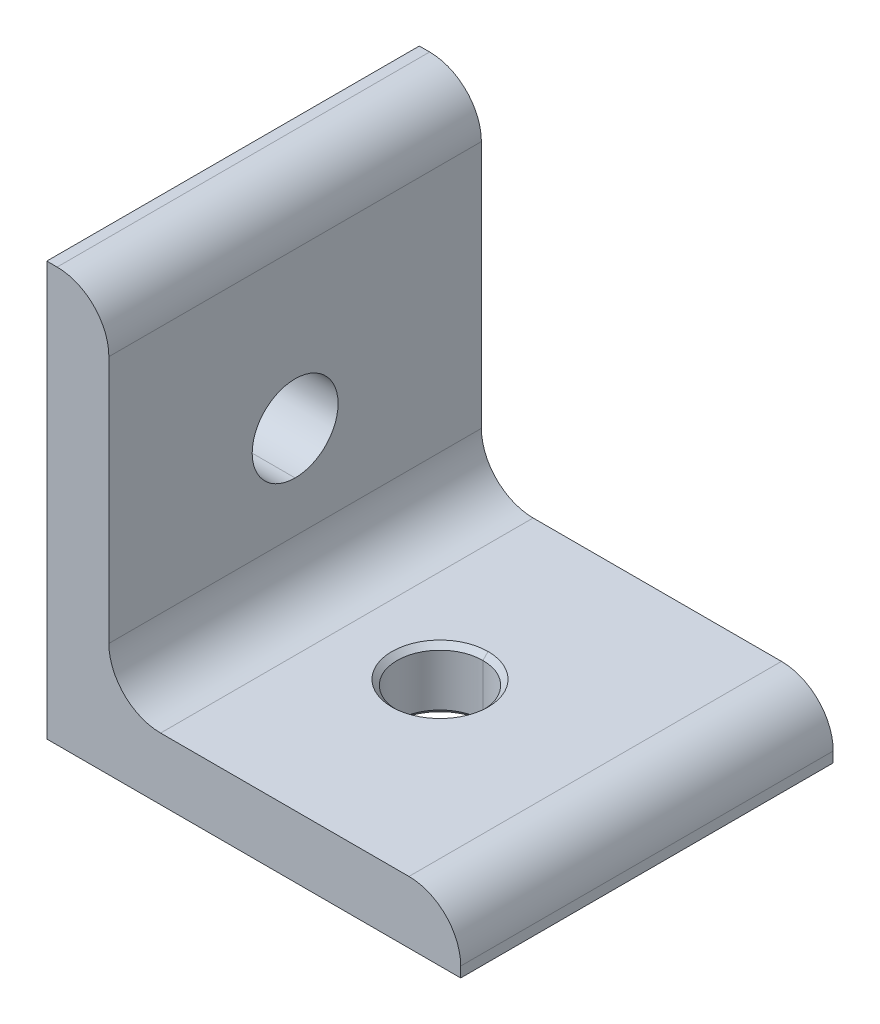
ISO-10303-21;
HEADER;
FILE_DESCRIPTION(('STEP AP214'),'2;1');
FILE_NAME('part.step','',(''),(''),'','','');
FILE_SCHEMA(('AUTOMOTIVE_DESIGN { 1 0 10303 214 1 1 1 1 }'));
ENDSEC;
DATA;
#1=APPLICATION_CONTEXT('core data for automotive mechanical design processes');
#2=APPLICATION_PROTOCOL_DEFINITION('international standard','automotive_design',2000,#1);
#3=PRODUCT_CONTEXT('',#1,'mechanical');
#4=PRODUCT('Part','Part','',(#3));
#5=PRODUCT_RELATED_PRODUCT_CATEGORY('part','',(#4));
#6=PRODUCT_DEFINITION_FORMATION('','',#4);
#7=PRODUCT_DEFINITION_CONTEXT('part definition',#1,'design');
#8=PRODUCT_DEFINITION('design','',#6,#7);
#9=PRODUCT_DEFINITION_SHAPE('','',#8);
#10=(LENGTH_UNIT() NAMED_UNIT(*) SI_UNIT(.MILLI.,.METRE.));
#11=(NAMED_UNIT(*) PLANE_ANGLE_UNIT() SI_UNIT($,.RADIAN.));
#12=(NAMED_UNIT(*) SI_UNIT($,.STERADIAN.) SOLID_ANGLE_UNIT());
#13=UNCERTAINTY_MEASURE_WITH_UNIT(LENGTH_MEASURE(1.E-05),#10,'distance_accuracy_value','');
#14=(GEOMETRIC_REPRESENTATION_CONTEXT(3) GLOBAL_UNCERTAINTY_ASSIGNED_CONTEXT((#13)) GLOBAL_UNIT_ASSIGNED_CONTEXT((#10,
#11,#12)) REPRESENTATION_CONTEXT('',''));
#15=CARTESIAN_POINT('',(0.,0.,0.));
#16=DIRECTION('',(0.,0.,1.));
#17=DIRECTION('',(1.,0.,0.));
#18=AXIS2_PLACEMENT_3D('',#15,#16,#17);
#19=CARTESIAN_POINT('',(310.435821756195,291.02165795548,0.));
#20=DIRECTION('',(0.,1.,0.));
#21=DIRECTION('',(0.,0.,-1.));
#22=AXIS2_PLACEMENT_3D('',#19,#20,#21);
#23=CYLINDRICAL_SURFACE('',#22,4.15);
#24=DIRECTION('',(0.,-1.,0.));
#25=VECTOR('',#24,1.);
#26=CARTESIAN_POINT('',(310.435821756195,296.12165795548,-4.15000000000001));
#27=LINE('',#26,#25);
#28=CARTESIAN_POINT('',(310.435821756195,296.12165795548,-4.15000000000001));
#29=VERTEX_POINT('',#28);
#30=CARTESIAN_POINT('',(310.435821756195,291.12165795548,-4.15000000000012));
#31=VERTEX_POINT('',#30);
#32=EDGE_CURVE('E51',#29,#31,#27,.T.);
#33=ORIENTED_EDGE('',*,*,#32,.T.);
#34=CARTESIAN_POINT('',(310.435821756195,291.12165795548,0.));
#35=DIRECTION('',(0.,1.,0.));
#36=DIRECTION('',(-1.5204820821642E-09,0.,1.));
#37=AXIS2_PLACEMENT_3D('',#34,#35,#36);
#38=CIRCLE('',#37,4.1500000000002);
#39=CARTESIAN_POINT('',(310.435821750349,291.12165795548,4.15000000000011));
#40=VERTEX_POINT('',#39);
#41=EDGE_CURVE('E321',#40,#31,#38,.T.);
#42=ORIENTED_EDGE('',*,*,#41,.F.);
#43=DIRECTION('',(0.,1.,0.));
#44=VECTOR('',#43,1.);
#45=CARTESIAN_POINT('',(310.435821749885,291.12165795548,4.14999999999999));
#46=LINE('',#45,#44);
#47=CARTESIAN_POINT('',(310.435821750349,296.12165795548,4.14999999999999));
#48=VERTEX_POINT('',#47);
#49=EDGE_CURVE('E68',#40,#48,#46,.T.);
#50=ORIENTED_EDGE('',*,*,#49,.T.);
#51=CARTESIAN_POINT('',(310.435821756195,296.12165795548,0.));
#52=DIRECTION('',(0.,-1.,0.));
#53=DIRECTION('',(0.,0.,-1.));
#54=AXIS2_PLACEMENT_3D('',#51,#52,#53);
#55=CIRCLE('',#54,4.15);
#56=EDGE_CURVE('E12',#29,#48,#55,.T.);
#57=ORIENTED_EDGE('',*,*,#56,.F.);
#58=EDGE_LOOP('',(#33,#42,#50,#57));
#59=FACE_BOUND('',#58,.T.);
#60=ADVANCED_FACE('F48',(#59),#23,.F.);
#61=CARTESIAN_POINT('',(310.435821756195,296.064762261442,0.));
#62=DIRECTION('',(0.,1.,0.));
#63=DIRECTION('',(0.,0.,-1.));
#64=AXIS2_PLACEMENT_3D('',#61,#62,#63);
#65=CONICAL_SURFACE('',#64,4.09310430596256,0.785398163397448);
#66=DIRECTION('',(0.,-0.707106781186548,0.707106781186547));
#67=VECTOR('',#66,1.);
#68=CARTESIAN_POINT('',(310.435821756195,296.62165795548,-4.65000000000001));
#69=LINE('',#68,#67);
#70=CARTESIAN_POINT('',(310.435821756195,296.62165795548,-4.65000000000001));
#71=VERTEX_POINT('',#70);
#72=EDGE_CURVE('E340',#71,#29,#69,.T.);
#73=ORIENTED_EDGE('',*,*,#72,.T.);
#74=ORIENTED_EDGE('',*,*,#56,.T.);
#75=DIRECTION('',(-9.16977266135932E-10,0.707106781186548,0.707106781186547));
#76=VECTOR('',#75,1.);
#77=CARTESIAN_POINT('',(310.435821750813,296.12165795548,4.14999999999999));
#78=LINE('',#77,#76);
#79=CARTESIAN_POINT('',(310.435821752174,296.62165795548,4.64999999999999));
#80=VERTEX_POINT('',#79);
#81=EDGE_CURVE('E57',#48,#80,#78,.T.);
#82=ORIENTED_EDGE('',*,*,#81,.T.);
#83=CARTESIAN_POINT('',(310.435821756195,296.62165795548,0.));
#84=DIRECTION('',(0.,-1.,0.));
#85=DIRECTION('',(0.,0.,-1.));
#86=AXIS2_PLACEMENT_3D('',#83,#84,#85);
#87=CIRCLE('',#86,4.65);
#88=EDGE_CURVE('E215',#71,#80,#87,.T.);
#89=ORIENTED_EDGE('',*,*,#88,.F.);
#90=EDGE_LOOP('',(#73,#74,#82,#89));
#91=FACE_BOUND('',#90,.T.);
#92=ADVANCED_FACE('F416',(#91),#65,.F.);
#93=CARTESIAN_POINT('',(310.435821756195,296.064762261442,0.));
#94=DIRECTION('',(0.,1.,0.));
#95=DIRECTION('',(0.,0.,-1.));
#96=AXIS2_PLACEMENT_3D('',#93,#94,#95);
#97=CONICAL_SURFACE('',#96,4.09310430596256,0.785398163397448);
#98=ORIENTED_EDGE('',*,*,#81,.F.);
#99=CARTESIAN_POINT('',(310.435821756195,296.12165795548,0.));
#100=DIRECTION('',(0.,-1.,0.));
#101=DIRECTION('',(-1.52048208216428E-09,0.,1.));
#102=AXIS2_PLACEMENT_3D('',#99,#100,#101);
#103=CIRCLE('',#102,4.15);
#104=EDGE_CURVE('E332',#48,#29,#103,.T.);
#105=ORIENTED_EDGE('',*,*,#104,.T.);
#106=ORIENTED_EDGE('',*,*,#72,.F.);
#107=CARTESIAN_POINT('',(310.435821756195,296.62165795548,0.));
#108=DIRECTION('',(0.,-1.,0.));
#109=DIRECTION('',(0.,0.,1.));
#110=AXIS2_PLACEMENT_3D('',#107,#108,#109);
#111=CIRCLE('',#110,4.65);
#112=EDGE_CURVE('E254',#80,#71,#111,.T.);
#113=ORIENTED_EDGE('',*,*,#112,.F.);
#114=EDGE_LOOP('',(#98,#105,#106,#113));
#115=FACE_BOUND('',#114,.T.);
#116=ADVANCED_FACE('F420',(#115),#97,.F.);
#117=CARTESIAN_POINT('',(310.435821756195,291.02165795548,0.));
#118=DIRECTION('',(0.,1.,0.));
#119=DIRECTION('',(0.,0.,-1.));
#120=AXIS2_PLACEMENT_3D('',#117,#118,#119);
#121=CYLINDRICAL_SURFACE('',#120,4.15);
#122=ORIENTED_EDGE('',*,*,#49,.F.);
#123=CARTESIAN_POINT('',(310.435821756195,291.12165795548,0.));
#124=DIRECTION('',(0.,1.,0.));
#125=DIRECTION('',(0.,0.,-1.));
#126=AXIS2_PLACEMENT_3D('',#123,#124,#125);
#127=CIRCLE('',#126,4.1500000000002);
#128=EDGE_CURVE('E328',#31,#40,#127,.T.);
#129=ORIENTED_EDGE('',*,*,#128,.F.);
#130=ORIENTED_EDGE('',*,*,#32,.F.);
#131=ORIENTED_EDGE('',*,*,#104,.F.);
#132=EDGE_LOOP('',(#122,#129,#130,#131));
#133=FACE_BOUND('',#132,.T.);
#134=ADVANCED_FACE('F349',(#133),#121,.F.);
#135=CARTESIAN_POINT('',(310.435821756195,291.178553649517,0.));
#136=DIRECTION('',(0.,-1.,0.));
#137=DIRECTION('',(0.,0.,-1.));
#138=AXIS2_PLACEMENT_3D('',#135,#136,#137);
#139=CONICAL_SURFACE('',#138,4.09310430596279,0.785398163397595);
#140=DIRECTION('',(0.,0.707106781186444,0.707106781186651));
#141=VECTOR('',#140,1.);
#142=CARTESIAN_POINT('',(310.435821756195,290.62165795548,-4.65000000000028));
#143=LINE('',#142,#141);
#144=CARTESIAN_POINT('',(310.435821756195,290.62165795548,-4.6500000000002));
#145=VERTEX_POINT('',#144);
#146=EDGE_CURVE('E317',#145,#31,#143,.T.);
#147=ORIENTED_EDGE('',*,*,#146,.T.);
#148=ORIENTED_EDGE('',*,*,#128,.T.);
#149=DIRECTION('',(-9.16964903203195E-10,-0.707106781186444,0.707106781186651));
#150=VECTOR('',#149,1.);
#151=CARTESIAN_POINT('',(310.435821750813,291.12165795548,4.15000000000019));
#152=LINE('',#151,#150);
#153=CARTESIAN_POINT('',(310.435821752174,290.62165795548,4.65000000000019));
#154=VERTEX_POINT('',#153);
#155=EDGE_CURVE('E325',#40,#154,#152,.T.);
#156=ORIENTED_EDGE('',*,*,#155,.T.);
#157=CARTESIAN_POINT('',(310.435821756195,290.62165795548,0.));
#158=DIRECTION('',(0.,1.,0.));
#159=DIRECTION('',(0.,0.,-1.));
#160=AXIS2_PLACEMENT_3D('',#157,#158,#159);
#161=CIRCLE('',#160,4.65000000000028);
#162=EDGE_CURVE('E276',#145,#154,#161,.T.);
#163=ORIENTED_EDGE('',*,*,#162,.F.);
#164=EDGE_LOOP('',(#147,#148,#156,#163));
#165=FACE_BOUND('',#164,.T.);
#166=ADVANCED_FACE('F353',(#165),#139,.F.);
#167=CARTESIAN_POINT('',(310.435821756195,291.178553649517,0.));
#168=DIRECTION('',(0.,-1.,0.));
#169=DIRECTION('',(0.,0.,-1.));
#170=AXIS2_PLACEMENT_3D('',#167,#168,#169);
#171=CONICAL_SURFACE('',#170,4.09310430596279,0.785398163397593);
#172=ORIENTED_EDGE('',*,*,#155,.F.);
#173=ORIENTED_EDGE('',*,*,#41,.T.);
#174=ORIENTED_EDGE('',*,*,#146,.F.);
#175=CARTESIAN_POINT('',(310.435821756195,290.62165795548,0.));
#176=DIRECTION('',(0.,1.,0.));
#177=DIRECTION('',(0.,0.,1.));
#178=AXIS2_PLACEMENT_3D('',#175,#176,#177);
#179=CIRCLE('',#178,4.65000000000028);
#180=EDGE_CURVE('E272',#154,#145,#179,.T.);
#181=ORIENTED_EDGE('',*,*,#180,.F.);
#182=EDGE_LOOP('',(#172,#173,#174,#181));
#183=FACE_BOUND('',#182,.T.);
#184=ADVANCED_FACE('F356',(#183),#171,.F.);
#185=CARTESIAN_POINT('',(290.315821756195,310.62165795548,0.));
#186=DIRECTION('',(1.,0.,0.));
#187=DIRECTION('',(0.,1.,0.));
#188=AXIS2_PLACEMENT_3D('',#185,#186,#187);
#189=CYLINDRICAL_SURFACE('',#188,4.15);
#190=DIRECTION('',(-1.,0.,0.));
#191=VECTOR('',#190,1.);
#192=CARTESIAN_POINT('',(296.435821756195,314.77165795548,0.));
#193=LINE('',#192,#191);
#194=CARTESIAN_POINT('',(296.435821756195,314.77165795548,0.));
#195=VERTEX_POINT('',#194);
#196=CARTESIAN_POINT('',(290.435821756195,314.77165795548,0.));
#197=VERTEX_POINT('',#196);
#198=EDGE_CURVE('E305',#195,#197,#193,.T.);
#199=ORIENTED_EDGE('',*,*,#198,.T.);
#200=CARTESIAN_POINT('',(290.435821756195,310.62165795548,0.));
#201=DIRECTION('',(1.,0.,0.));
#202=DIRECTION('',(0.,-1.,0.));
#203=AXIS2_PLACEMENT_3D('',#200,#201,#202);
#204=CIRCLE('',#203,4.15);
#205=CARTESIAN_POINT('',(290.435821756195,306.47165795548,0.));
#206=VERTEX_POINT('',#205);
#207=EDGE_CURVE('E306',#206,#197,#204,.T.);
#208=ORIENTED_EDGE('',*,*,#207,.F.);
#209=DIRECTION('',(1.,0.,0.));
#210=VECTOR('',#209,1.);
#211=CARTESIAN_POINT('',(290.435821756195,306.47165795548,0.));
#212=LINE('',#211,#210);
#213=CARTESIAN_POINT('',(296.435821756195,306.47165795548,0.));
#214=VERTEX_POINT('',#213);
#215=EDGE_CURVE('E309',#206,#214,#212,.T.);
#216=ORIENTED_EDGE('',*,*,#215,.T.);
#217=CARTESIAN_POINT('',(296.435821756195,310.62165795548,0.));
#218=DIRECTION('',(-1.,0.,0.));
#219=DIRECTION('',(0.,1.,0.));
#220=AXIS2_PLACEMENT_3D('',#217,#218,#219);
#221=CIRCLE('',#220,4.15);
#222=EDGE_CURVE('E237',#195,#214,#221,.T.);
#223=ORIENTED_EDGE('',*,*,#222,.F.);
#224=EDGE_LOOP('',(#199,#208,#216,#223));
#225=FACE_BOUND('',#224,.T.);
#226=ADVANCED_FACE('F387',(#225),#189,.F.);
#227=CARTESIAN_POINT('',(290.315821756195,310.62165795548,0.));
#228=DIRECTION('',(1.,0.,0.));
#229=DIRECTION('',(0.,1.,0.));
#230=AXIS2_PLACEMENT_3D('',#227,#228,#229);
#231=CYLINDRICAL_SURFACE('',#230,4.15);
#232=ORIENTED_EDGE('',*,*,#215,.F.);
#233=CARTESIAN_POINT('',(290.435821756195,310.62165795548,0.));
#234=DIRECTION('',(1.,0.,0.));
#235=DIRECTION('',(0.,1.,0.));
#236=AXIS2_PLACEMENT_3D('',#233,#234,#235);
#237=CIRCLE('',#236,4.15);
#238=EDGE_CURVE('E287',#197,#206,#237,.T.);
#239=ORIENTED_EDGE('',*,*,#238,.F.);
#240=ORIENTED_EDGE('',*,*,#198,.F.);
#241=CARTESIAN_POINT('',(296.435821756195,310.62165795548,0.));
#242=DIRECTION('',(-1.,0.,0.));
#243=DIRECTION('',(0.,-1.,0.));
#244=AXIS2_PLACEMENT_3D('',#241,#242,#243);
#245=CIRCLE('',#244,4.15);
#246=EDGE_CURVE('E242',#214,#195,#245,.T.);
#247=ORIENTED_EDGE('',*,*,#246,.F.);
#248=EDGE_LOOP('',(#232,#239,#240,#247));
#249=FACE_BOUND('',#248,.T.);
#250=ADVANCED_FACE('F383',(#249),#231,.F.);
#251=CARTESIAN_POINT('',(310.435821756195,310.62165795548,18.));
#252=DIRECTION('',(0.,0.,1.));
#253=DIRECTION('',(1.,0.,0.));
#254=AXIS2_PLACEMENT_3D('',#251,#252,#253);
#255=PLANE('',#254);
#256=DIRECTION('',(-1.,0.,0.));
#257=VECTOR('',#256,1.);
#258=CARTESIAN_POINT('',(291.435821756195,330.62165795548,18.));
#259=LINE('',#258,#257);
#260=CARTESIAN_POINT('',(291.435821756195,330.62165795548,18.));
#261=VERTEX_POINT('',#260);
#262=CARTESIAN_POINT('',(290.435821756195,330.62165795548,18.));
#263=VERTEX_POINT('',#262);
#264=EDGE_CURVE('E298',#261,#263,#259,.T.);
#265=ORIENTED_EDGE('',*,*,#264,.T.);
#266=DIRECTION('',(0.,-1.,0.));
#267=VECTOR('',#266,1.);
#268=CARTESIAN_POINT('',(290.435821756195,330.62165795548,18.));
#269=LINE('',#268,#267);
#270=CARTESIAN_POINT('',(290.435821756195,290.62165795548,18.));
#271=VERTEX_POINT('',#270);
#272=EDGE_CURVE('E314',#263,#271,#269,.T.);
#273=ORIENTED_EDGE('',*,*,#272,.T.);
#274=DIRECTION('',(1.,0.,0.));
#275=VECTOR('',#274,1.);
#276=CARTESIAN_POINT('',(290.435821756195,290.62165795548,18.));
#277=LINE('',#276,#275);
#278=CARTESIAN_POINT('',(330.435821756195,290.62165795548,18.));
#279=VERTEX_POINT('',#278);
#280=EDGE_CURVE('E226',#271,#279,#277,.T.);
#281=ORIENTED_EDGE('',*,*,#280,.T.);
#282=DIRECTION('',(0.,1.,0.));
#283=VECTOR('',#282,1.);
#284=CARTESIAN_POINT('',(330.435821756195,290.62165795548,18.));
#285=LINE('',#284,#283);
#286=CARTESIAN_POINT('',(330.435821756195,291.62165795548,18.));
#287=VERTEX_POINT('',#286);
#288=EDGE_CURVE('E221',#279,#287,#285,.T.);
#289=ORIENTED_EDGE('',*,*,#288,.T.);
#290=CARTESIAN_POINT('',(325.435821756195,291.62165795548,18.));
#291=DIRECTION('',(0.,0.,1.));
#292=DIRECTION('',(1.,0.,0.));
#293=AXIS2_PLACEMENT_3D('',#290,#291,#292);
#294=CIRCLE('',#293,5.);
#295=CARTESIAN_POINT('',(325.435821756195,296.62165795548,18.));
#296=VERTEX_POINT('',#295);
#297=EDGE_CURVE('E216',#287,#296,#294,.T.);
#298=ORIENTED_EDGE('',*,*,#297,.T.);
#299=DIRECTION('',(-1.,0.,0.));
#300=VECTOR('',#299,1.);
#301=CARTESIAN_POINT('',(325.435821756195,296.62165795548,18.));
#302=LINE('',#301,#300);
#303=CARTESIAN_POINT('',(301.435821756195,296.62165795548,18.));
#304=VERTEX_POINT('',#303);
#305=EDGE_CURVE('E212',#296,#304,#302,.T.);
#306=ORIENTED_EDGE('',*,*,#305,.T.);
#307=CARTESIAN_POINT('',(301.435821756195,301.62165795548,18.));
#308=DIRECTION('',(0.,0.,-1.));
#309=DIRECTION('',(0.,-1.,0.));
#310=AXIS2_PLACEMENT_3D('',#307,#308,#309);
#311=CIRCLE('',#310,5.);
#312=CARTESIAN_POINT('',(296.435821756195,301.62165795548,18.));
#313=VERTEX_POINT('',#312);
#314=EDGE_CURVE('E202',#304,#313,#311,.T.);
#315=ORIENTED_EDGE('',*,*,#314,.T.);
#316=DIRECTION('',(0.,1.,0.));
#317=VECTOR('',#316,1.);
#318=CARTESIAN_POINT('',(296.435821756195,301.62165795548,18.));
#319=LINE('',#318,#317);
#320=CARTESIAN_POINT('',(296.435821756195,325.62165795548,18.));
#321=VERTEX_POINT('',#320);
#322=EDGE_CURVE('E209',#313,#321,#319,.T.);
#323=ORIENTED_EDGE('',*,*,#322,.T.);
#324=CARTESIAN_POINT('',(291.435821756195,325.62165795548,18.));
#325=DIRECTION('',(0.,0.,1.));
#326=DIRECTION('',(1.,0.,0.));
#327=AXIS2_PLACEMENT_3D('',#324,#325,#326);
#328=CIRCLE('',#327,5.);
#329=EDGE_CURVE('E174',#321,#261,#328,.T.);
#330=ORIENTED_EDGE('',*,*,#329,.T.);
#331=EDGE_LOOP('',(#265,#273,#281,#289,#298,#306,#315,#323,#330));
#332=FACE_BOUND('',#331,.T.);
#333=ADVANCED_FACE('F297',(#332),#255,.T.);
#334=CARTESIAN_POINT('',(290.935821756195,330.62165795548,0.));
#335=DIRECTION('',(0.,1.,0.));
#336=DIRECTION('',(-1.,0.,0.));
#337=AXIS2_PLACEMENT_3D('',#334,#335,#336);
#338=PLANE('',#337);
#339=DIRECTION('',(-1.,0.,0.));
#340=VECTOR('',#339,1.);
#341=CARTESIAN_POINT('',(291.435821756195,330.62165795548,-18.));
#342=LINE('',#341,#340);
#343=CARTESIAN_POINT('',(291.435821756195,330.62165795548,-18.));
#344=VERTEX_POINT('',#343);
#345=CARTESIAN_POINT('',(290.435821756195,330.62165795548,-18.));
#346=VERTEX_POINT('',#345);
#347=EDGE_CURVE('E179',#344,#346,#342,.T.);
#348=ORIENTED_EDGE('',*,*,#347,.T.);
#349=DIRECTION('',(0.,0.,1.));
#350=VECTOR('',#349,1.);
#351=CARTESIAN_POINT('',(290.435821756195,330.62165795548,-18.));
#352=LINE('',#351,#350);
#353=EDGE_CURVE('E280',#346,#263,#352,.T.);
#354=ORIENTED_EDGE('',*,*,#353,.T.);
#355=ORIENTED_EDGE('',*,*,#264,.F.);
#356=DIRECTION('',(0.,0.,-1.));
#357=VECTOR('',#356,1.);
#358=CARTESIAN_POINT('',(291.435821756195,330.62165795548,18.));
#359=LINE('',#358,#357);
#360=EDGE_CURVE('E193',#261,#344,#359,.T.);
#361=ORIENTED_EDGE('',*,*,#360,.T.);
#362=EDGE_LOOP('',(#348,#354,#355,#361));
#363=FACE_BOUND('',#362,.T.);
#364=ADVANCED_FACE('F301',(#363),#338,.T.);
#365=CARTESIAN_POINT('',(290.435821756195,310.62165795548,0.));
#366=DIRECTION('',(1.,0.,0.));
#367=DIRECTION('',(0.,-1.,0.));
#368=AXIS2_PLACEMENT_3D('',#365,#366,#367);
#369=PLANE('',#368);
#370=ORIENTED_EDGE('',*,*,#207,.T.);
#371=ORIENTED_EDGE('',*,*,#238,.T.);
#372=EDGE_LOOP('',(#370,#371));
#373=FACE_BOUND('',#372,.T.);
#374=DIRECTION('',(0.,0.,1.));
#375=VECTOR('',#374,1.);
#376=CARTESIAN_POINT('',(290.435821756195,290.62165795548,-18.));
#377=LINE('',#376,#375);
#378=CARTESIAN_POINT('',(290.435821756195,290.62165795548,-18.));
#379=VERTEX_POINT('',#378);
#380=EDGE_CURVE('E225',#379,#271,#377,.T.);
#381=ORIENTED_EDGE('',*,*,#380,.T.);
#382=ORIENTED_EDGE('',*,*,#272,.F.);
#383=ORIENTED_EDGE('',*,*,#353,.F.);
#384=DIRECTION('',(0.,-1.,0.));
#385=VECTOR('',#384,1.);
#386=CARTESIAN_POINT('',(290.435821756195,330.62165795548,-18.));
#387=LINE('',#386,#385);
#388=EDGE_CURVE('E183',#346,#379,#387,.T.);
#389=ORIENTED_EDGE('',*,*,#388,.T.);
#390=EDGE_LOOP('',(#381,#382,#383,#389));
#391=FACE_BOUND('',#390,.T.);
#392=ADVANCED_FACE('F362',(#373,#391),#369,.F.);
#393=CARTESIAN_POINT('',(310.435821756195,290.62165795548,0.));
#394=DIRECTION('',(0.,1.,0.));
#395=DIRECTION('',(1.,0.,0.));
#396=AXIS2_PLACEMENT_3D('',#393,#394,#395);
#397=PLANE('',#396);
#398=ORIENTED_EDGE('',*,*,#162,.T.);
#399=ORIENTED_EDGE('',*,*,#180,.T.);
#400=EDGE_LOOP('',(#398,#399));
#401=FACE_BOUND('',#400,.T.);
#402=DIRECTION('',(0.,0.,1.));
#403=VECTOR('',#402,1.);
#404=CARTESIAN_POINT('',(330.435821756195,290.62165795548,-18.));
#405=LINE('',#404,#403);
#406=CARTESIAN_POINT('',(330.435821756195,290.62165795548,-18.));
#407=VERTEX_POINT('',#406);
#408=EDGE_CURVE('E219',#407,#279,#405,.T.);
#409=ORIENTED_EDGE('',*,*,#408,.T.);
#410=ORIENTED_EDGE('',*,*,#280,.F.);
#411=ORIENTED_EDGE('',*,*,#380,.F.);
#412=DIRECTION('',(1.,0.,0.));
#413=VECTOR('',#412,1.);
#414=CARTESIAN_POINT('',(290.435821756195,290.62165795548,-18.));
#415=LINE('',#414,#413);
#416=EDGE_CURVE('E266',#379,#407,#415,.T.);
#417=ORIENTED_EDGE('',*,*,#416,.T.);
#418=EDGE_LOOP('',(#409,#410,#411,#417));
#419=FACE_BOUND('',#418,.T.);
#420=ADVANCED_FACE('F358',(#401,#419),#397,.F.);
#421=CARTESIAN_POINT('',(330.435821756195,291.12165795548,0.));
#422=DIRECTION('',(1.,0.,0.));
#423=DIRECTION('',(0.,1.,0.));
#424=AXIS2_PLACEMENT_3D('',#421,#422,#423);
#425=PLANE('',#424);
#426=ORIENTED_EDGE('',*,*,#288,.F.);
#427=ORIENTED_EDGE('',*,*,#408,.F.);
#428=DIRECTION('',(0.,1.,0.));
#429=VECTOR('',#428,1.);
#430=CARTESIAN_POINT('',(330.435821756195,290.62165795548,-18.));
#431=LINE('',#430,#429);
#432=CARTESIAN_POINT('',(330.435821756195,291.62165795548,-18.));
#433=VERTEX_POINT('',#432);
#434=EDGE_CURVE('E190',#407,#433,#431,.T.);
#435=ORIENTED_EDGE('',*,*,#434,.T.);
#436=DIRECTION('',(0.,0.,1.));
#437=VECTOR('',#436,1.);
#438=CARTESIAN_POINT('',(330.435821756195,291.62165795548,-18.));
#439=LINE('',#438,#437);
#440=EDGE_CURVE('E220',#433,#287,#439,.T.);
#441=ORIENTED_EDGE('',*,*,#440,.T.);
#442=EDGE_LOOP('',(#426,#427,#435,#441));
#443=FACE_BOUND('',#442,.T.);
#444=ADVANCED_FACE('F361',(#443),#425,.T.);
#445=CARTESIAN_POINT('',(325.435821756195,291.62165795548,18.72));
#446=DIRECTION('',(0.,0.,-1.));
#447=DIRECTION('',(0.,1.,0.));
#448=AXIS2_PLACEMENT_3D('',#445,#446,#447);
#449=CYLINDRICAL_SURFACE('',#448,5.);
#450=DIRECTION('',(0.,0.,-1.));
#451=VECTOR('',#450,1.);
#452=CARTESIAN_POINT('',(325.435821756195,296.62165795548,18.));
#453=LINE('',#452,#451);
#454=CARTESIAN_POINT('',(325.435821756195,296.62165795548,-18.));
#455=VERTEX_POINT('',#454);
#456=EDGE_CURVE('E207',#296,#455,#453,.T.);
#457=ORIENTED_EDGE('',*,*,#456,.F.);
#458=ORIENTED_EDGE('',*,*,#297,.F.);
#459=ORIENTED_EDGE('',*,*,#440,.F.);
#460=CARTESIAN_POINT('',(325.435821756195,291.62165795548,-18.));
#461=DIRECTION('',(0.,0.,1.));
#462=DIRECTION('',(1.,0.,0.));
#463=AXIS2_PLACEMENT_3D('',#460,#461,#462);
#464=CIRCLE('',#463,5.);
#465=EDGE_CURVE('E186',#433,#455,#464,.T.);
#466=ORIENTED_EDGE('',*,*,#465,.T.);
#467=EDGE_LOOP('',(#457,#458,#459,#466));
#468=FACE_BOUND('',#467,.T.);
#469=ADVANCED_FACE('F398',(#468),#449,.T.);
#470=CARTESIAN_POINT('',(313.435821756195,296.62165795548,0.));
#471=DIRECTION('',(0.,1.,0.));
#472=DIRECTION('',(-1.,0.,0.));
#473=AXIS2_PLACEMENT_3D('',#470,#471,#472);
#474=PLANE('',#473);
#475=ORIENTED_EDGE('',*,*,#112,.T.);
#476=ORIENTED_EDGE('',*,*,#88,.T.);
#477=EDGE_LOOP('',(#475,#476));
#478=FACE_BOUND('',#477,.T.);
#479=DIRECTION('',(-1.,0.,0.));
#480=VECTOR('',#479,1.);
#481=CARTESIAN_POINT('',(325.435821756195,296.62165795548,-18.));
#482=LINE('',#481,#480);
#483=CARTESIAN_POINT('',(301.435821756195,296.62165795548,-18.));
#484=VERTEX_POINT('',#483);
#485=EDGE_CURVE('E189',#455,#484,#482,.T.);
#486=ORIENTED_EDGE('',*,*,#485,.T.);
#487=DIRECTION('',(0.,0.,-1.));
#488=VECTOR('',#487,1.);
#489=CARTESIAN_POINT('',(301.435821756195,296.62165795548,18.));
#490=LINE('',#489,#488);
#491=EDGE_CURVE('E208',#304,#484,#490,.T.);
#492=ORIENTED_EDGE('',*,*,#491,.F.);
#493=ORIENTED_EDGE('',*,*,#305,.F.);
#494=ORIENTED_EDGE('',*,*,#456,.T.);
#495=EDGE_LOOP('',(#486,#492,#493,#494));
#496=FACE_BOUND('',#495,.T.);
#497=ADVANCED_FACE('F402',(#478,#496),#474,.T.);
#498=CARTESIAN_POINT('',(301.435821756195,301.62165795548,-18.72));
#499=DIRECTION('',(0.,0.,1.));
#500=DIRECTION('',(-1.,0.,0.));
#501=AXIS2_PLACEMENT_3D('',#498,#499,#500);
#502=CYLINDRICAL_SURFACE('',#501,5.);
#503=ORIENTED_EDGE('',*,*,#314,.F.);
#504=ORIENTED_EDGE('',*,*,#491,.T.);
#505=CARTESIAN_POINT('',(301.435821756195,301.62165795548,-18.));
#506=DIRECTION('',(0.,0.,-1.));
#507=DIRECTION('',(0.,-1.,0.));
#508=AXIS2_PLACEMENT_3D('',#505,#506,#507);
#509=CIRCLE('',#508,5.);
#510=CARTESIAN_POINT('',(296.435821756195,301.62165795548,-18.));
#511=VERTEX_POINT('',#510);
#512=EDGE_CURVE('E166',#484,#511,#509,.T.);
#513=ORIENTED_EDGE('',*,*,#512,.T.);
#514=DIRECTION('',(0.,0.,1.));
#515=VECTOR('',#514,1.);
#516=CARTESIAN_POINT('',(296.435821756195,301.62165795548,-18.));
#517=LINE('',#516,#515);
#518=EDGE_CURVE('E161',#511,#313,#517,.T.);
#519=ORIENTED_EDGE('',*,*,#518,.T.);
#520=EDGE_LOOP('',(#503,#504,#513,#519));
#521=FACE_BOUND('',#520,.T.);
#522=ADVANCED_FACE('F405',(#521),#502,.F.);
#523=CARTESIAN_POINT('',(296.435821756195,313.62165795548,0.));
#524=DIRECTION('',(1.,0.,0.));
#525=DIRECTION('',(0.,1.,0.));
#526=AXIS2_PLACEMENT_3D('',#523,#524,#525);
#527=PLANE('',#526);
#528=ORIENTED_EDGE('',*,*,#222,.T.);
#529=ORIENTED_EDGE('',*,*,#246,.T.);
#530=EDGE_LOOP('',(#528,#529));
#531=FACE_BOUND('',#530,.T.);
#532=ORIENTED_EDGE('',*,*,#322,.F.);
#533=ORIENTED_EDGE('',*,*,#518,.F.);
#534=DIRECTION('',(0.,1.,0.));
#535=VECTOR('',#534,1.);
#536=CARTESIAN_POINT('',(296.435821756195,301.62165795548,-18.));
#537=LINE('',#536,#535);
#538=CARTESIAN_POINT('',(296.435821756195,325.62165795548,-18.));
#539=VERTEX_POINT('',#538);
#540=EDGE_CURVE('E154',#511,#539,#537,.T.);
#541=ORIENTED_EDGE('',*,*,#540,.T.);
#542=DIRECTION('',(0.,0.,1.));
#543=VECTOR('',#542,1.);
#544=CARTESIAN_POINT('',(296.435821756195,325.62165795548,-18.));
#545=LINE('',#544,#543);
#546=EDGE_CURVE('E158',#539,#321,#545,.T.);
#547=ORIENTED_EDGE('',*,*,#546,.T.);
#548=EDGE_LOOP('',(#532,#533,#541,#547));
#549=FACE_BOUND('',#548,.T.);
#550=ADVANCED_FACE('F157',(#531,#549),#527,.T.);
#551=CARTESIAN_POINT('',(291.435821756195,325.62165795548,18.72));
#552=DIRECTION('',(0.,0.,-1.));
#553=DIRECTION('',(0.,1.,0.));
#554=AXIS2_PLACEMENT_3D('',#551,#552,#553);
#555=CYLINDRICAL_SURFACE('',#554,5.);
#556=ORIENTED_EDGE('',*,*,#360,.F.);
#557=ORIENTED_EDGE('',*,*,#329,.F.);
#558=ORIENTED_EDGE('',*,*,#546,.F.);
#559=CARTESIAN_POINT('',(291.435821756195,325.62165795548,-18.));
#560=DIRECTION('',(0.,0.,1.));
#561=DIRECTION('',(1.,0.,0.));
#562=AXIS2_PLACEMENT_3D('',#559,#560,#561);
#563=CIRCLE('',#562,5.);
#564=EDGE_CURVE('E172',#539,#344,#563,.T.);
#565=ORIENTED_EDGE('',*,*,#564,.T.);
#566=EDGE_LOOP('',(#556,#557,#558,#565));
#567=FACE_BOUND('',#566,.T.);
#568=ADVANCED_FACE('F171',(#567),#555,.T.);
#569=CARTESIAN_POINT('',(310.435821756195,310.62165795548,-18.));
#570=DIRECTION('',(0.,0.,1.));
#571=DIRECTION('',(1.,0.,0.));
#572=AXIS2_PLACEMENT_3D('',#569,#570,#571);
#573=PLANE('',#572);
#574=ORIENTED_EDGE('',*,*,#540,.F.);
#575=ORIENTED_EDGE('',*,*,#512,.F.);
#576=ORIENTED_EDGE('',*,*,#485,.F.);
#577=ORIENTED_EDGE('',*,*,#465,.F.);
#578=ORIENTED_EDGE('',*,*,#434,.F.);
#579=ORIENTED_EDGE('',*,*,#416,.F.);
#580=ORIENTED_EDGE('',*,*,#388,.F.);
#581=ORIENTED_EDGE('',*,*,#347,.F.);
#582=ORIENTED_EDGE('',*,*,#564,.F.);
#583=EDGE_LOOP('',(#574,#575,#576,#577,#578,#579,#580,#581,#582));
#584=FACE_BOUND('',#583,.T.);
#585=ADVANCED_FACE('F177',(#584),#573,.F.);
#586=CLOSED_SHELL('',(#60,#92,#116,#134,#166,#184,#226,#250,#333,#364,#392,#420,#444,#469,#497,
#522,#550,#568,#585));
#587=MANIFOLD_SOLID_BREP('B2',#586);
#588=ADVANCED_BREP_SHAPE_REPRESENTATION('',(#18,#587),#14);
#589=SHAPE_DEFINITION_REPRESENTATION(#9,#588);
ENDSEC;
END-ISO-10303-21;
